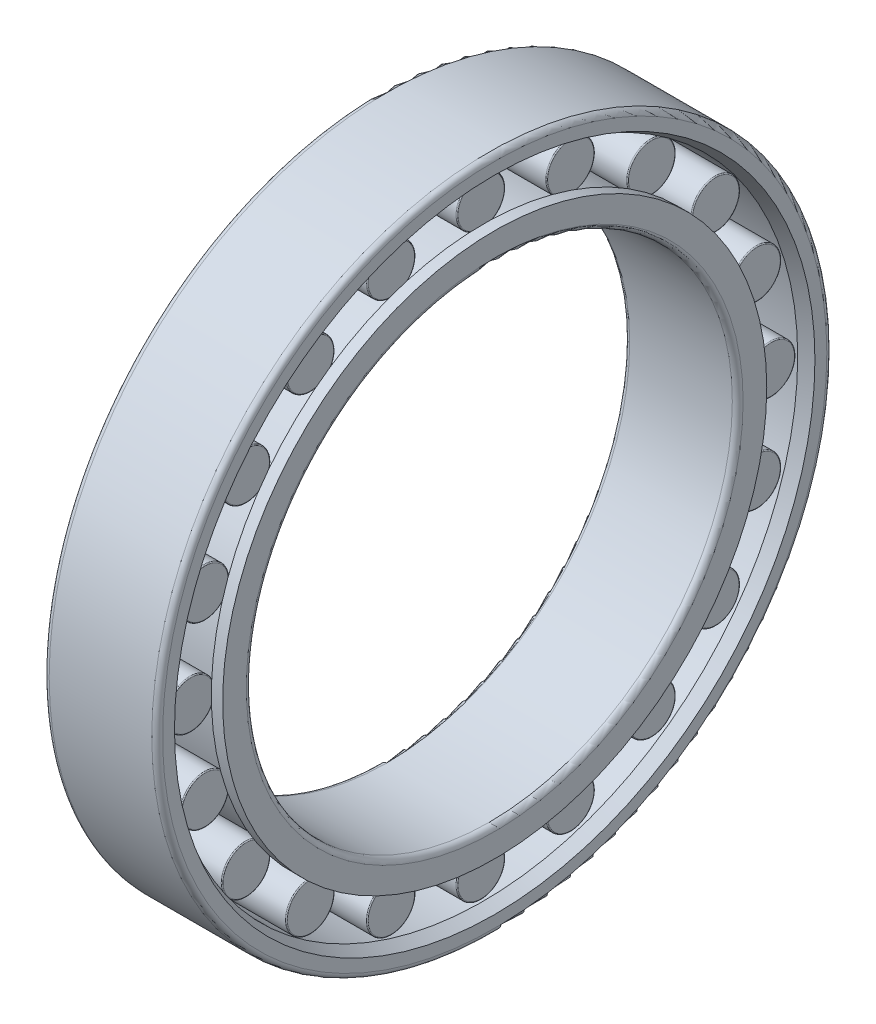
from build123d import *

# Parameters (mm, degrees)
ROLLERSDETAILED_COUNT = 20
ROLLERSDETAILED_ANGLE = 342.0000000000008


with BuildPart() as part:
    # OutRacSke → OuterRace (revolve)
    with BuildSketch(Plane.XY, mode=Mode.PRIVATE) as outerrace_sk:
        with BuildLine():
            Line((16.79999999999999, 116.42000000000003), (21.000000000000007, 118.594375))
            Line((21.000000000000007, 118.594375), (21, 123))
            ThreePointArc((21, 123), (20.414213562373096, 124.41421356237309), (19, 125))
            Line((19, 125), (-19, 125))
            ThreePointArc((-19, 125), (-20.414213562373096, 124.41421356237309), (-21, 123))
            Line((-21, 123), (-20.999999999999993, 118.594375))
            Line((-20.999999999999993, 118.594375), (-16.800000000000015, 116.42000000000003))
            Line((-16.800000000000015, 116.42000000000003), (16.79999999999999, 116.42000000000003))
        make_face()
    revolve(outerrace_sk.sketch.rotate(Axis((-90, 0, 0), (1, 0, 0)), 270), axis=Axis((-90, 0, 0), (1, 0, 0)))

    # RolDetSke → RollerDetailed (revolve)
    with BuildSketch(Plane.XY, mode=Mode.PRIVATE) as rollerdetailed_sk:
        with BuildLine():
            Line((-15.96000000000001, 116.06800000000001), (-15.960000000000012, 107.5))
            Line((-15.960000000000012, 107.5), (15.959999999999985, 107.50000000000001))
            Line((15.959999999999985, 107.50000000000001), (15.959999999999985, 116.068))
            ThreePointArc((15.959999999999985, 116.068), (15.855437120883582, 116.3204371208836), (15.602999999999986, 116.425))
            Line((15.602999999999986, 116.425), (-15.60300000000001, 116.42499999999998))
            ThreePointArc((-15.60300000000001, 116.42499999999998), (-15.855437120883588, 116.32043712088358), (-15.96000000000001, 116.06800000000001))
        make_face()
    rollerdetailed = revolve(rollerdetailed_sk.sketch.rotate(Axis((-33.6, 107.5, 0), (1, 0, 0)), 270), axis=Axis((-33.6, 107.5, 0), (1, 0, 0)))

    # InsRacSke → InnerRace (revolve)
    with BuildSketch(Plane.XY, mode=Mode.PRIVATE) as innerrace_sk:
        with BuildLine():
            Line((16.800000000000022, 98.58), (16.800000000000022, 100.75437499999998))
            Line((16.800000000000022, 100.75437499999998), (20.999999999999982, 100.75437499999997))
            Line((20.999999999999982, 100.75437499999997), (21, 92))
            ThreePointArc((21, 92), (20.414213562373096, 90.58578643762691), (19, 90))
            Line((19, 90), (-19, 90))
            ThreePointArc((-19, 90), (-20.414213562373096, 90.58578643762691), (-21, 92))
            Line((-21, 92), (-21.00000000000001, 100.75437499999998))
            Line((-21.00000000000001, 100.75437499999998), (-16.799999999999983, 100.75437499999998))
            Line((-16.799999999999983, 100.75437499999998), (-16.799999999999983, 98.58))
            Line((-16.799999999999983, 98.58), (16.800000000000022, 98.58))
        make_face()
    revolve(innerrace_sk.sketch.rotate(Axis((-90, 0, 0), (1, 0, 0)), 270), axis=Axis((-90, 0, 0), (1, 0, 0)))

    # RollersDetailed: RollerDetailed ×20 about axis
    rollersdetailed_axis = Axis((-50, 0, 0), (1, 0, 0))
    for i in range(1, ROLLERSDETAILED_COUNT):
        add(rollerdetailed.rotate(rollersdetailed_axis, i * ROLLERSDETAILED_ANGLE / (ROLLERSDETAILED_COUNT - 1)))


solid = part.part
